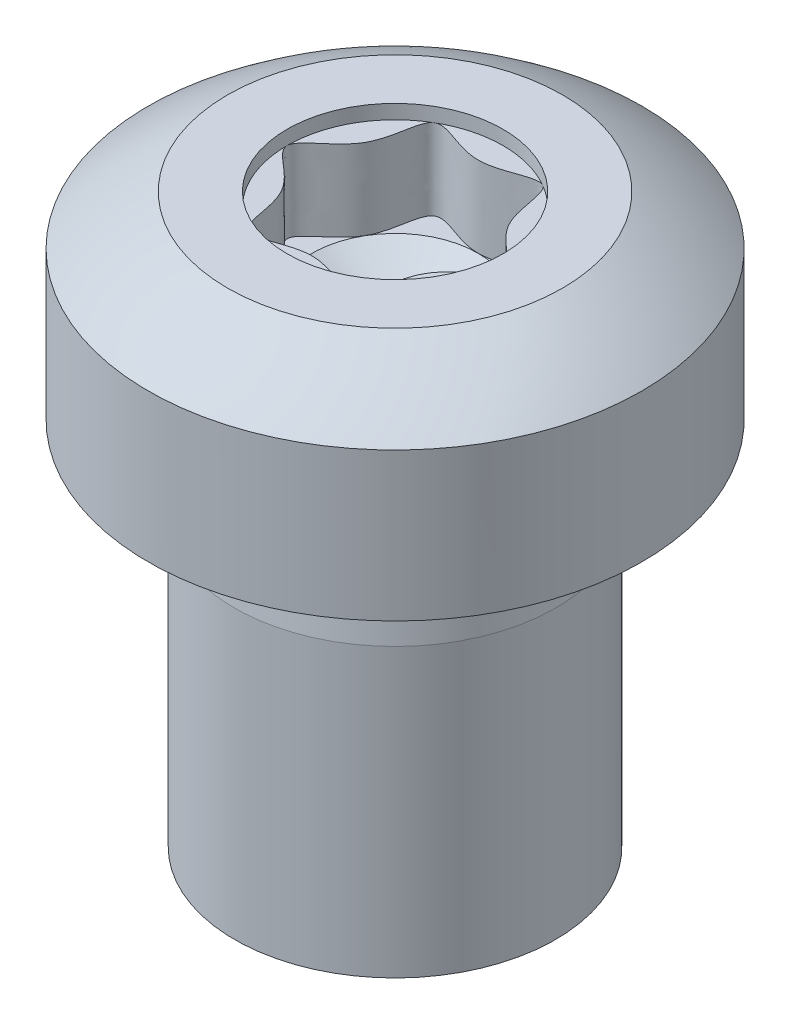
ISO-10303-21;
HEADER;
FILE_DESCRIPTION(('STEP AP214'),'2;1');
FILE_NAME('part.step','',(''),(''),'','','');
FILE_SCHEMA(('AUTOMOTIVE_DESIGN { 1 0 10303 214 1 1 1 1 }'));
ENDSEC;
DATA;
#1=APPLICATION_CONTEXT('core data for automotive mechanical design processes');
#2=APPLICATION_PROTOCOL_DEFINITION('international standard','automotive_design',2000,#1);
#3=PRODUCT_CONTEXT('',#1,'mechanical');
#4=PRODUCT('Part','Part','',(#3));
#5=PRODUCT_RELATED_PRODUCT_CATEGORY('part','',(#4));
#6=PRODUCT_DEFINITION_FORMATION('','',#4);
#7=PRODUCT_DEFINITION_CONTEXT('part definition',#1,'design');
#8=PRODUCT_DEFINITION('design','',#6,#7);
#9=PRODUCT_DEFINITION_SHAPE('','',#8);
#10=(LENGTH_UNIT() NAMED_UNIT(*) SI_UNIT(.MILLI.,.METRE.));
#11=(NAMED_UNIT(*) PLANE_ANGLE_UNIT() SI_UNIT($,.RADIAN.));
#12=(NAMED_UNIT(*) SI_UNIT($,.STERADIAN.) SOLID_ANGLE_UNIT());
#13=UNCERTAINTY_MEASURE_WITH_UNIT(LENGTH_MEASURE(1.E-05),#10,'distance_accuracy_value','');
#14=(GEOMETRIC_REPRESENTATION_CONTEXT(3) GLOBAL_UNCERTAINTY_ASSIGNED_CONTEXT((#13)) GLOBAL_UNIT_ASSIGNED_CONTEXT((#10,
#11,#12)) REPRESENTATION_CONTEXT('',''));
#15=CARTESIAN_POINT('',(0.,0.,0.));
#16=DIRECTION('',(0.,0.,1.));
#17=DIRECTION('',(1.,0.,0.));
#18=AXIS2_PLACEMENT_3D('',#15,#16,#17);
#19=CARTESIAN_POINT('',(2.,4.6,0.));
#20=DIRECTION('',(0.,1.,0.));
#21=DIRECTION('',(0.,0.,1.));
#22=AXIS2_PLACEMENT_3D('',#19,#20,#21);
#23=PLANE('',#22);
#24=CARTESIAN_POINT('',(0.,4.6,0.));
#25=DIRECTION('',(0.,1.,0.));
#26=DIRECTION('',(0.,0.,1.));
#27=AXIS2_PLACEMENT_3D('',#24,#25,#26);
#28=CIRCLE('',#27,0.875);
#29=CARTESIAN_POINT('',(0.,4.6,0.875));
#30=VERTEX_POINT('',#29);
#31=EDGE_CURVE('E107',#30,#30,#28,.T.);
#32=ORIENTED_EDGE('',*,*,#31,.F.);
#33=EDGE_LOOP('',(#32));
#34=FACE_BOUND('',#33,.T.);
#35=CARTESIAN_POINT('',(0.,4.6,0.));
#36=DIRECTION('',(0.,1.,0.));
#37=DIRECTION('',(0.,0.,1.));
#38=AXIS2_PLACEMENT_3D('',#35,#36,#37);
#39=CIRCLE('',#38,1.35705587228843);
#40=CARTESIAN_POINT('',(1.35705587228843,4.6,0.));
#41=VERTEX_POINT('',#40);
#42=EDGE_CURVE('E152',#41,#41,#39,.T.);
#43=ORIENTED_EDGE('',*,*,#42,.T.);
#44=EDGE_LOOP('',(#43));
#45=FACE_BOUND('',#44,.T.);
#46=ADVANCED_FACE('F35',(#34,#45),#23,.T.);
#47=CARTESIAN_POINT('',(0.,0.,0.));
#48=DIRECTION('',(0.,-1.,0.));
#49=DIRECTION('',(0.,0.,-1.));
#50=AXIS2_PLACEMENT_3D('',#47,#48,#49);
#51=CYLINDRICAL_SURFACE('',#50,2.);
#52=CARTESIAN_POINT('',(0.,3.,0.));
#53=DIRECTION('',(0.,-1.,0.));
#54=DIRECTION('',(0.,0.,-1.));
#55=AXIS2_PLACEMENT_3D('',#52,#53,#54);
#56=CIRCLE('',#55,2.);
#57=CARTESIAN_POINT('',(0.,3.,-2.));
#58=VERTEX_POINT('',#57);
#59=EDGE_CURVE('E144',#58,#58,#56,.T.);
#60=ORIENTED_EDGE('',*,*,#59,.F.);
#61=EDGE_LOOP('',(#60));
#62=FACE_BOUND('',#61,.T.);
#63=CARTESIAN_POINT('',(0.,4.2,0.));
#64=DIRECTION('',(0.,-1.,0.));
#65=DIRECTION('',(0.,0.,-1.));
#66=AXIS2_PLACEMENT_3D('',#63,#64,#65);
#67=CIRCLE('',#66,2.);
#68=CARTESIAN_POINT('',(2.,4.2,0.));
#69=VERTEX_POINT('',#68);
#70=EDGE_CURVE('E149',#69,#69,#67,.T.);
#71=ORIENTED_EDGE('',*,*,#70,.T.);
#72=EDGE_LOOP('',(#71));
#73=FACE_BOUND('',#72,.T.);
#74=ADVANCED_FACE('F199',(#62,#73),#51,.T.);
#75=CARTESIAN_POINT('',(1.3,3.,0.));
#76=DIRECTION('',(0.,-1.,0.));
#77=DIRECTION('',(0.,0.,-1.));
#78=AXIS2_PLACEMENT_3D('',#75,#76,#77);
#79=PLANE('',#78);
#80=ORIENTED_EDGE('',*,*,#59,.T.);
#81=EDGE_LOOP('',(#80));
#82=FACE_BOUND('',#81,.T.);
#83=CARTESIAN_POINT('',(0.,3.,0.));
#84=DIRECTION('',(0.,-1.,0.));
#85=DIRECTION('',(0.,0.,-1.));
#86=AXIS2_PLACEMENT_3D('',#83,#84,#85);
#87=CIRCLE('',#86,1.3);
#88=CARTESIAN_POINT('',(0.,3.,-1.3));
#89=VERTEX_POINT('',#88);
#90=EDGE_CURVE('E164',#89,#89,#87,.T.);
#91=ORIENTED_EDGE('',*,*,#90,.F.);
#92=EDGE_LOOP('',(#91));
#93=FACE_BOUND('',#92,.T.);
#94=ADVANCED_FACE('F195',(#82,#93),#79,.T.);
#95=CARTESIAN_POINT('',(0.,1.70200080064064,0.));
#96=DIRECTION('',(0.,-1.,0.));
#97=DIRECTION('',(1.,0.,0.));
#98=AXIS2_PLACEMENT_3D('',#95,#96,#97);
#99=SPHERICAL_SURFACE('',#98,3.2);
#100=CARTESIAN_POINT('',(2.,4.2,0.));
#101=CARTESIAN_POINT('',(1.99382822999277,4.20494137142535,0.));
#102=CARTESIAN_POINT('',(1.98763814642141,4.20985986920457,0.));
#103=CARTESIAN_POINT('',(1.97522169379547,4.21965084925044,0.));
#104=CARTESIAN_POINT('',(1.96899532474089,4.2245233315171,0.));
#105=CARTESIAN_POINT('',(1.95650664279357,4.23422201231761,0.));
#106=CARTESIAN_POINT('',(1.95024432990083,4.23904821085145,0.));
#107=CARTESIAN_POINT('',(1.93768410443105,4.24865405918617,0.));
#108=CARTESIAN_POINT('',(1.93138619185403,4.25343370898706,0.));
#109=CARTESIAN_POINT('',(1.91875511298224,4.26294619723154,0.));
#110=CARTESIAN_POINT('',(1.91242194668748,4.26767903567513,0.));
#111=CARTESIAN_POINT('',(1.89972070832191,4.27709764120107,0.));
#112=CARTESIAN_POINT('',(1.8933526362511,4.28178340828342,0.));
#113=CARTESIAN_POINT('',(1.88058193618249,4.2911076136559,0.));
#114=CARTESIAN_POINT('',(1.8741793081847,4.29574605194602,0.));
#115=CARTESIAN_POINT('',(1.86133984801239,4.30497534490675,0.));
#116=CARTESIAN_POINT('',(1.85490301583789,4.30956619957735,0.));
#117=CARTESIAN_POINT('',(1.84199550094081,4.31870007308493,0.));
#118=CARTESIAN_POINT('',(1.83552481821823,4.32324309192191,0.));
#119=CARTESIAN_POINT('',(1.82254995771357,4.33228104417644,0.));
#120=CARTESIAN_POINT('',(1.81604577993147,4.336775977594,0.));
#121=CARTESIAN_POINT('',(1.80300428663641,4.34571751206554,0.));
#122=CARTESIAN_POINT('',(1.79646697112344,4.35016411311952,0.));
#123=CARTESIAN_POINT('',(1.78335956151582,4.35900873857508,0.));
#124=CARTESIAN_POINT('',(1.77678946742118,4.36340676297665,0.));
#125=CARTESIAN_POINT('',(1.76361686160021,4.37215399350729,0.));
#126=CARTESIAN_POINT('',(1.75701434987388,4.37650319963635,0.));
#127=CARTESIAN_POINT('',(1.7437772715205,4.38515255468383,0.));
#128=CARTESIAN_POINT('',(1.73714270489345,4.38945270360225,0.));
#129=CARTESIAN_POINT('',(1.72384188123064,4.39800370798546,0.));
#130=CARTESIAN_POINT('',(1.71717562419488,4.40225456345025,0.));
#131=CARTESIAN_POINT('',(1.70381178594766,4.41070674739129,0.));
#132=CARTESIAN_POINT('',(1.69711420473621,4.41490807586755,0.));
#133=CARTESIAN_POINT('',(1.68368808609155,4.42326097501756,0.));
#134=CARTESIAN_POINT('',(1.67695954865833,4.42741254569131,0.));
#135=CARTESIAN_POINT('',(1.66347188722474,4.43566570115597,0.));
#136=CARTESIAN_POINT('',(1.65671276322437,4.43976728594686,0.));
#137=CARTESIAN_POINT('',(1.64316429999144,4.44792024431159,0.));
#138=CARTESIAN_POINT('',(1.63637496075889,4.45197161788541,0.));
#139=CARTESIAN_POINT('',(1.62276644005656,4.46002393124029,0.));
#140=CARTESIAN_POINT('',(1.61594725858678,4.46402487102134,0.));
#141=CARTESIAN_POINT('',(1.60227942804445,4.47197609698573,0.));
#142=CARTESIAN_POINT('',(1.59543077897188,4.47592638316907,0.));
#143=CARTESIAN_POINT('',(1.58170438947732,4.4837760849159,0.));
#144=CARTESIAN_POINT('',(1.57482664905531,4.4876755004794,0.));
#145=CARTESIAN_POINT('',(1.56104245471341,4.49542324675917,0.));
#146=CARTESIAN_POINT('',(1.55413600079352,4.49927157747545,0.));
#147=CARTESIAN_POINT('',(1.54029475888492,4.50691694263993,0.));
#148=CARTESIAN_POINT('',(1.5333599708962,4.51071397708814,0.));
#149=CARTESIAN_POINT('',(1.51946244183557,4.51825654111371,0.));
#150=CARTESIAN_POINT('',(1.51249970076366,4.52200207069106,0.));
#151=CARTESIAN_POINT('',(1.49854664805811,4.52944141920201,0.));
#152=CARTESIAN_POINT('',(1.49155633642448,4.5331352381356,0.));
#153=CARTESIAN_POINT('',(1.47754852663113,4.54047096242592,0.));
#154=CARTESIAN_POINT('',(1.47053102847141,4.54411286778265,0.));
#155=CARTESIAN_POINT('',(1.45646923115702,4.55134456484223,0.));
#156=CARTESIAN_POINT('',(1.44942493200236,4.55493435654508,0.));
#157=CARTESIAN_POINT('',(1.43530991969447,4.56206162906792,0.));
#158=CARTESIAN_POINT('',(1.42823920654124,4.56559910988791,0.));
#159=CARTESIAN_POINT('',(1.41407175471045,4.57262156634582,0.));
#160=CARTESIAN_POINT('',(1.40697501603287,4.57610654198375,0.));
#161=CARTESIAN_POINT('',(1.39275590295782,4.58302379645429,0.));
#162=CARTESIAN_POINT('',(1.38563352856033,4.5864560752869,0.));
#163=CARTESIAN_POINT('',(1.37136353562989,4.59326774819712,0.));
#164=CARTESIAN_POINT('',(1.36421591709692,4.59664714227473,0.));
#165=CARTESIAN_POINT('',(1.35705587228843,4.6,0.));
#166=B_SPLINE_CURVE_WITH_KNOTS('',3,(#100,#101,#102,#103,#104,#105,#106,#107,#108,#109,#110,
#111,#112,#113,#114,#115,#116,#117,#118,#119,#120,#121,#122,#123,#124,#125,#126,#127,#128,#129,
#130,#131,#132,#133,#134,#135,#136,#137,#138,#139,#140,#141,#142,#143,#144,#145,#146,#147,#148,
#149,#150,#151,#152,#153,#154,#155,#156,#157,#158,#159,#160,#161,#162,#163,#164,#165),
.UNSPECIFIED.,.F.,.F.,(4,2,2,2,2,2,2,2,2,2,2,2,2,2,2,2,2,2,2,2,2,2,2,2,2,2,2,2,2,2,2,2,4),(0.,
0.0237185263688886,0.0474370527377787,0.0711555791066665,0.0948741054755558,0.118592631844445,
0.142311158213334,0.166029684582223,0.189748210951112,0.213466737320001,0.237185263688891,
0.260903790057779,0.284622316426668,0.308340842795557,0.332059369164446,0.355777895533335,
0.379496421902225,0.403214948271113,0.426933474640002,0.450652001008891,0.474370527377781,
0.49808905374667,0.521807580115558,0.545526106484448,0.569244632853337,0.592963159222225,
0.616681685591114,0.640400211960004,0.664118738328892,0.687837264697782,0.71155579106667,
0.73527431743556,0.758992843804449),.UNSPECIFIED.);
#167=EDGE_CURVE('BSEAM191',#69,#41,#166,.T.);
#168=ORIENTED_EDGE('',*,*,#70,.F.);
#169=ORIENTED_EDGE('',*,*,#42,.F.);
#170=ORIENTED_EDGE('',*,*,#167,.T.);
#171=ORIENTED_EDGE('',*,*,#167,.F.);
#172=EDGE_LOOP('',(#168,#170,#169,#171));
#173=FACE_BOUND('',#172,.T.);
#174=ADVANCED_FACE('F191',(#173),#99,.T.);
#175=CARTESIAN_POINT('',(0.,2.32643678,0.));
#176=DIRECTION('',(0.,-1.,0.));
#177=DIRECTION('',(0.,0.,-1.));
#178=AXIS2_PLACEMENT_3D('',#175,#176,#177);
#179=CONICAL_SURFACE('',#178,1.3,0.0979868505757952);
#180=CARTESIAN_POINT('',(0.,2.9,0.));
#181=DIRECTION('',(0.,-1.,0.));
#182=DIRECTION('',(0.,0.,-1.));
#183=AXIS2_PLACEMENT_3D('',#180,#181,#182);
#184=CIRCLE('',#183,1.24361778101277);
#185=CARTESIAN_POINT('',(0.,2.9,-1.24361778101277));
#186=VERTEX_POINT('',#185);
#187=EDGE_CURVE('E159',#186,#186,#184,.T.);
#188=ORIENTED_EDGE('',*,*,#187,.T.);
#189=EDGE_LOOP('',(#188));
#190=FACE_BOUND('',#189,.T.);
#191=CARTESIAN_POINT('',(0.,2.32643678,0.));
#192=DIRECTION('',(0.,-1.,0.));
#193=DIRECTION('',(0.,0.,-1.));
#194=AXIS2_PLACEMENT_3D('',#191,#192,#193);
#195=CIRCLE('',#194,1.3);
#196=CARTESIAN_POINT('',(0.,2.32643678,-1.3));
#197=VERTEX_POINT('',#196);
#198=EDGE_CURVE('E154',#197,#197,#195,.T.);
#199=ORIENTED_EDGE('',*,*,#198,.F.);
#200=EDGE_LOOP('',(#199));
#201=FACE_BOUND('',#200,.T.);
#202=ADVANCED_FACE('F187',(#190,#201),#179,.T.);
#203=CARTESIAN_POINT('',(0.,2.90978301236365,0.));
#204=DIRECTION('',(0.,-1.,0.));
#205=DIRECTION('',(0.,0.,-1.));
#206=AXIS2_PLACEMENT_3D('',#203,#204,#205);
#207=TOROIDAL_SURFACE('',#206,1.34313809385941,0.1);
#208=ORIENTED_EDGE('',*,*,#90,.T.);
#209=EDGE_LOOP('',(#208));
#210=FACE_BOUND('',#209,.T.);
#211=ORIENTED_EDGE('',*,*,#187,.F.);
#212=EDGE_LOOP('',(#211));
#213=FACE_BOUND('',#212,.T.);
#214=ADVANCED_FACE('F184',(#210,#213),#207,.F.);
#215=CARTESIAN_POINT('',(0.,0.,0.));
#216=DIRECTION('',(0.,-1.,0.));
#217=DIRECTION('',(0.,0.,-1.));
#218=AXIS2_PLACEMENT_3D('',#215,#216,#217);
#219=PLANE('',#218);
#220=CARTESIAN_POINT('',(0.,0.,0.));
#221=DIRECTION('',(0.,-1.,0.));
#222=DIRECTION('',(0.,0.,-1.));
#223=AXIS2_PLACEMENT_3D('',#220,#221,#222);
#224=CIRCLE('',#223,1.3);
#225=CARTESIAN_POINT('',(0.,0.,-1.3));
#226=VERTEX_POINT('',#225);
#227=EDGE_CURVE('E139',#226,#226,#224,.T.);
#228=ORIENTED_EDGE('',*,*,#227,.T.);
#229=EDGE_LOOP('',(#228));
#230=FACE_BOUND('',#229,.T.);
#231=ADVANCED_FACE('F37',(#230),#219,.T.);
#232=CARTESIAN_POINT('',(0.,0.,0.));
#233=DIRECTION('',(0.,-1.,0.));
#234=DIRECTION('',(0.,0.,-1.));
#235=AXIS2_PLACEMENT_3D('',#232,#233,#234);
#236=CYLINDRICAL_SURFACE('',#235,1.3);
#237=ORIENTED_EDGE('',*,*,#227,.F.);
#238=EDGE_LOOP('',(#237));
#239=FACE_BOUND('',#238,.T.);
#240=ORIENTED_EDGE('',*,*,#198,.T.);
#241=EDGE_LOOP('',(#240));
#242=FACE_BOUND('',#241,.T.);
#243=ADVANCED_FACE('F206',(#239,#242),#236,.T.);
#244=CARTESIAN_POINT('',(0.,4.4845,0.));
#245=DIRECTION('',(0.,1.,0.));
#246=DIRECTION('',(0.,0.,1.));
#247=AXIS2_PLACEMENT_3D('',#244,#245,#246);
#248=CYLINDRICAL_SURFACE('',#247,0.875);
#249=ORIENTED_EDGE('',*,*,#31,.T.);
#250=EDGE_LOOP('',(#249));
#251=FACE_BOUND('',#250,.T.);
#252=CARTESIAN_POINT('',(0.,4.4845,0.));
#253=DIRECTION('',(0.,1.,0.));
#254=DIRECTION('',(0.,0.,1.));
#255=AXIS2_PLACEMENT_3D('',#252,#253,#254);
#256=CIRCLE('',#255,0.875);
#257=CARTESIAN_POINT('',(-0.437500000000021,4.4845,-0.757772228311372));
#258=VERTEX_POINT('',#257);
#259=CARTESIAN_POINT('',(-0.875,4.4845,0.));
#260=VERTEX_POINT('',#259);
#261=EDGE_CURVE('E393',#258,#260,#256,.T.);
#262=ORIENTED_EDGE('',*,*,#261,.F.);
#263=CARTESIAN_POINT('',(0.437499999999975,4.4845,-0.757772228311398));
#264=VERTEX_POINT('',#263);
#265=EDGE_CURVE('E395',#264,#258,#256,.T.);
#266=ORIENTED_EDGE('',*,*,#265,.F.);
#267=CARTESIAN_POINT('',(0.875,4.4845,0.));
#268=VERTEX_POINT('',#267);
#269=EDGE_CURVE('E114',#268,#264,#256,.T.);
#270=ORIENTED_EDGE('',*,*,#269,.F.);
#271=CARTESIAN_POINT('',(0.437500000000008,4.4845,0.757772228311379));
#272=VERTEX_POINT('',#271);
#273=EDGE_CURVE('E97',#272,#268,#256,.T.);
#274=ORIENTED_EDGE('',*,*,#273,.F.);
#275=CARTESIAN_POINT('',(-0.437499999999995,4.4845,0.757772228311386));
#276=VERTEX_POINT('',#275);
#277=EDGE_CURVE('E103',#276,#272,#256,.T.);
#278=ORIENTED_EDGE('',*,*,#277,.F.);
#279=EDGE_CURVE('E52',#260,#276,#256,.T.);
#280=ORIENTED_EDGE('',*,*,#279,.F.);
#281=EDGE_LOOP('',(#262,#266,#270,#274,#278,#280));
#282=FACE_BOUND('',#281,.T.);
#283=ADVANCED_FACE('F111',(#251,#282),#248,.F.);
#284=CARTESIAN_POINT('',(0.,4.4845,0.));
#285=DIRECTION('',(0.,1.,0.));
#286=DIRECTION('',(0.,0.,1.));
#287=AXIS2_PLACEMENT_3D('',#284,#285,#286);
#288=PLANE('',#287);
#289=ORIENTED_EDGE('',*,*,#277,.T.);
#290=CARTESIAN_POINT('',(-0.437499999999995,4.4845,0.757772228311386));
#291=CARTESIAN_POINT('',(-0.515892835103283,4.4845,0.712512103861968));
#292=CARTESIAN_POINT('',(-0.470357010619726,4.4845,0.271560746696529));
#293=CARTESIAN_POINT('',(-1.07732149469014,4.4845,0.));
#294=CARTESIAN_POINT('',(-0.470357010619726,4.4845,-0.271560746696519));
#295=CARTESIAN_POINT('',(-0.538660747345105,4.4845,-0.932987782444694));
#296=CARTESIAN_POINT('',(0.,4.4845,-0.543121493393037));
#297=CARTESIAN_POINT('',(0.538660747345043,4.4845,-0.9329877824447));
#298=CARTESIAN_POINT('',(0.470357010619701,4.4845,-0.271560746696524));
#299=CARTESIAN_POINT('',(1.07732149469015,4.4845,0.));
#300=CARTESIAN_POINT('',(0.470357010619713,4.4845,0.271560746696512));
#301=CARTESIAN_POINT('',(0.538660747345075,4.4845,0.932987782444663));
#302=CARTESIAN_POINT('',(0.,4.4845,0.543121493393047));
#303=CARTESIAN_POINT('',(-0.359107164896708,4.4845,0.803032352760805));
#304=CARTESIAN_POINT('',(-0.437499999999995,4.4845,0.757772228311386));
#305=B_SPLINE_CURVE_WITH_KNOTS('',3,(#290,#291,#292,#293,#294,#295,#296,#297,#298,#299,#300,
#301,#302,#303,#304),.UNSPECIFIED.,.T.,.F.,(4,1,1,1,1,1,1,1,1,1,1,1,4),(0.,0.083333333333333,
0.166666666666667,0.249999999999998,0.333333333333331,0.416666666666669,0.499999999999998,
0.583333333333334,0.66666666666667,0.750000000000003,0.833333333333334,0.916666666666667,1.),.UNSPECIFIED.);
#306=EDGE_CURVE('E11',#276,#272,#305,.F.);
#307=ORIENTED_EDGE('',*,*,#306,.F.);
#308=EDGE_LOOP('',(#289,#307));
#309=FACE_BOUND('',#308,.T.);
#310=ADVANCED_FACE('F104',(#309),#288,.T.);
#311=ORIENTED_EDGE('',*,*,#273,.T.);
#312=EDGE_CURVE('E46',#272,#268,#305,.F.);
#313=ORIENTED_EDGE('',*,*,#312,.F.);
#314=EDGE_LOOP('',(#311,#313));
#315=FACE_BOUND('',#314,.T.);
#316=ADVANCED_FACE('F95',(#315),#288,.T.);
#317=ORIENTED_EDGE('',*,*,#269,.T.);
#318=EDGE_CURVE('E100',#268,#264,#305,.F.);
#319=ORIENTED_EDGE('',*,*,#318,.F.);
#320=EDGE_LOOP('',(#317,#319));
#321=FACE_BOUND('',#320,.T.);
#322=ADVANCED_FACE('F274',(#321),#288,.T.);
#323=ORIENTED_EDGE('',*,*,#265,.T.);
#324=EDGE_CURVE('E120',#264,#258,#305,.F.);
#325=ORIENTED_EDGE('',*,*,#324,.F.);
#326=EDGE_LOOP('',(#323,#325));
#327=FACE_BOUND('',#326,.T.);
#328=ADVANCED_FACE('F282',(#327),#288,.T.);
#329=ORIENTED_EDGE('',*,*,#261,.T.);
#330=EDGE_CURVE('E118',#258,#260,#305,.F.);
#331=ORIENTED_EDGE('',*,*,#330,.F.);
#332=EDGE_LOOP('',(#329,#331));
#333=FACE_BOUND('',#332,.T.);
#334=ADVANCED_FACE('F291',(#333),#288,.T.);
#335=ORIENTED_EDGE('',*,*,#279,.T.);
#336=EDGE_CURVE('E39',#260,#276,#305,.F.);
#337=ORIENTED_EDGE('',*,*,#336,.F.);
#338=EDGE_LOOP('',(#335,#337));
#339=FACE_BOUND('',#338,.T.);
#340=ADVANCED_FACE('F266',(#339),#288,.T.);
#341=CARTESIAN_POINT('',(0.,3.44139885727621,0.));
#342=DIRECTION('',(0.,1.,0.));
#343=DIRECTION('',(0.,0.,1.));
#344=AXIS2_PLACEMENT_3D('',#341,#342,#343);
#345=CONICAL_SURFACE('',#344,0.,1.04719755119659);
#346=CARTESIAN_POINT('',(0.,3.83,0.));
#347=DIRECTION('',(0.,-1.,0.));
#348=DIRECTION('',(0.,0.,-1.));
#349=AXIS2_PLACEMENT_3D('',#346,#347,#348);
#350=CIRCLE('',#349,0.673076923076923);
#351=CARTESIAN_POINT('',(0.,3.83,-0.673076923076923));
#352=VERTEX_POINT('',#351);
#353=CARTESIAN_POINT('',(0.582901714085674,3.83,-0.336538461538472));
#354=VERTEX_POINT('',#353);
#355=EDGE_CURVE('E60',#352,#354,#350,.T.);
#356=ORIENTED_EDGE('',*,*,#355,.F.);
#357=CARTESIAN_POINT('',(-0.582901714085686,3.83,-0.33653846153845));
#358=VERTEX_POINT('',#357);
#359=EDGE_CURVE('E132',#358,#352,#350,.T.);
#360=ORIENTED_EDGE('',*,*,#359,.F.);
#361=CARTESIAN_POINT('',(-0.582901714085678,3.83,0.336538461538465));
#362=VERTEX_POINT('',#361);
#363=EDGE_CURVE('E138',#362,#358,#350,.T.);
#364=ORIENTED_EDGE('',*,*,#363,.F.);
#365=CARTESIAN_POINT('',(0.,3.83,0.673076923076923));
#366=VERTEX_POINT('',#365);
#367=EDGE_CURVE('E128',#366,#362,#350,.T.);
#368=ORIENTED_EDGE('',*,*,#367,.F.);
#369=CARTESIAN_POINT('',(0.582901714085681,3.83,0.336538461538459));
#370=VERTEX_POINT('',#369);
#371=EDGE_CURVE('E122',#370,#366,#350,.T.);
#372=ORIENTED_EDGE('',*,*,#371,.F.);
#373=EDGE_CURVE('E119',#354,#370,#350,.T.);
#374=ORIENTED_EDGE('',*,*,#373,.F.);
#375=EDGE_LOOP('',(#356,#360,#364,#368,#372,#374));
#376=FACE_BOUND('',#375,.T.);
#377=CARTESIAN_POINT('',(0.,3.44139885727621,0.));
#378=VERTEX_POINT('',#377);
#379=VERTEX_LOOP('',#378);
#380=FACE_BOUND('',#379,.T.);
#381=ADVANCED_FACE('F249',(#376,#380),#345,.F.);
#382=CARTESIAN_POINT('',(0.,3.83,0.));
#383=DIRECTION('',(0.,1.,0.));
#384=DIRECTION('',(0.,0.,1.));
#385=AXIS2_PLACEMENT_3D('',#382,#383,#384);
#386=PLANE('',#385);
#387=CARTESIAN_POINT('',(-0.437499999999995,3.83,0.757772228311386));
#388=CARTESIAN_POINT('',(-0.515892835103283,3.83,0.712512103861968));
#389=CARTESIAN_POINT('',(-0.470357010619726,3.83,0.271560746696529));
#390=CARTESIAN_POINT('',(-1.07732149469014,3.83,0.));
#391=CARTESIAN_POINT('',(-0.470357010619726,3.83,-0.271560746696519));
#392=CARTESIAN_POINT('',(-0.538660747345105,3.83,-0.932987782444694));
#393=CARTESIAN_POINT('',(0.,3.83,-0.543121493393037));
#394=CARTESIAN_POINT('',(0.538660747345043,3.83,-0.9329877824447));
#395=CARTESIAN_POINT('',(0.470357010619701,3.83,-0.271560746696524));
#396=CARTESIAN_POINT('',(1.07732149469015,3.83,0.));
#397=CARTESIAN_POINT('',(0.470357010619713,3.83,0.271560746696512));
#398=CARTESIAN_POINT('',(0.538660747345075,3.83,0.932987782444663));
#399=CARTESIAN_POINT('',(0.,3.83,0.543121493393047));
#400=CARTESIAN_POINT('',(-0.359107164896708,3.83,0.803032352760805));
#401=CARTESIAN_POINT('',(-0.437499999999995,3.83,0.757772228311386));
#402=B_SPLINE_CURVE_WITH_KNOTS('',3,(#387,#388,#389,#390,#391,#392,#393,#394,#395,#396,#397,
#398,#399,#400,#401),.UNSPECIFIED.,.T.,.F.,(4,1,1,1,1,1,1,1,1,1,1,1,4),(0.,0.083333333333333,
0.166666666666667,0.249999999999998,0.333333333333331,0.416666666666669,0.499999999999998,
0.583333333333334,0.66666666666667,0.750000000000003,0.833333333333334,0.916666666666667,1.),.UNSPECIFIED.);
#403=EDGE_CURVE('E131',#366,#362,#402,.T.);
#404=ORIENTED_EDGE('',*,*,#403,.F.);
#405=ORIENTED_EDGE('',*,*,#367,.T.);
#406=EDGE_LOOP('',(#404,#405));
#407=FACE_BOUND('',#406,.T.);
#408=ADVANCED_FACE('F321',(#407),#386,.T.);
#409=EDGE_CURVE('E136',#370,#366,#402,.T.);
#410=ORIENTED_EDGE('',*,*,#409,.F.);
#411=ORIENTED_EDGE('',*,*,#371,.T.);
#412=EDGE_LOOP('',(#410,#411));
#413=FACE_BOUND('',#412,.T.);
#414=ADVANCED_FACE('F337',(#413),#386,.T.);
#415=EDGE_CURVE('E372',#354,#370,#402,.T.);
#416=ORIENTED_EDGE('',*,*,#415,.F.);
#417=ORIENTED_EDGE('',*,*,#373,.T.);
#418=EDGE_LOOP('',(#416,#417));
#419=FACE_BOUND('',#418,.T.);
#420=ADVANCED_FACE('F331',(#419),#386,.T.);
#421=EDGE_CURVE('E373',#352,#354,#402,.T.);
#422=ORIENTED_EDGE('',*,*,#421,.F.);
#423=ORIENTED_EDGE('',*,*,#355,.T.);
#424=EDGE_LOOP('',(#422,#423));
#425=FACE_BOUND('',#424,.T.);
#426=ADVANCED_FACE('F182',(#425),#386,.T.);
#427=EDGE_CURVE('E172',#358,#352,#402,.T.);
#428=ORIENTED_EDGE('',*,*,#427,.F.);
#429=ORIENTED_EDGE('',*,*,#359,.T.);
#430=EDGE_LOOP('',(#428,#429));
#431=FACE_BOUND('',#430,.T.);
#432=ADVANCED_FACE('F319',(#431),#386,.T.);
#433=EDGE_CURVE('E137',#362,#358,#402,.T.);
#434=ORIENTED_EDGE('',*,*,#433,.F.);
#435=ORIENTED_EDGE('',*,*,#363,.T.);
#436=EDGE_LOOP('',(#434,#435));
#437=FACE_BOUND('',#436,.T.);
#438=ADVANCED_FACE('F180',(#437),#386,.T.);
#439=DIRECTION('',(0.,1.,0.));
#440=VECTOR('',#439,1.);
#441=SURFACE_OF_LINEAR_EXTRUSION('',#402,#440);
#442=ORIENTED_EDGE('',*,*,#433,.T.);
#443=ORIENTED_EDGE('',*,*,#427,.T.);
#444=ORIENTED_EDGE('',*,*,#421,.T.);
#445=ORIENTED_EDGE('',*,*,#415,.T.);
#446=ORIENTED_EDGE('',*,*,#409,.T.);
#447=ORIENTED_EDGE('',*,*,#403,.T.);
#448=EDGE_LOOP('',(#442,#443,#444,#445,#446,#447));
#449=FACE_BOUND('',#448,.T.);
#450=ORIENTED_EDGE('',*,*,#336,.T.);
#451=ORIENTED_EDGE('',*,*,#306,.T.);
#452=ORIENTED_EDGE('',*,*,#312,.T.);
#453=ORIENTED_EDGE('',*,*,#318,.T.);
#454=ORIENTED_EDGE('',*,*,#324,.T.);
#455=ORIENTED_EDGE('',*,*,#330,.T.);
#456=EDGE_LOOP('',(#450,#451,#452,#453,#454,#455));
#457=FACE_BOUND('',#456,.T.);
#458=ADVANCED_FACE('F115',(#449,#457),#441,.T.);
#459=CLOSED_SHELL('',(#46,#74,#94,#174,#202,#214,#231,#243,#283,#310,#316,#322,#328,#334,#340,
#381,#408,#414,#420,#426,#432,#438,#458));
#460=MANIFOLD_SOLID_BREP('B2',#459);
#461=ADVANCED_BREP_SHAPE_REPRESENTATION('',(#18,#460),#14);
#462=SHAPE_DEFINITION_REPRESENTATION(#9,#461);
ENDSEC;
END-ISO-10303-21;
